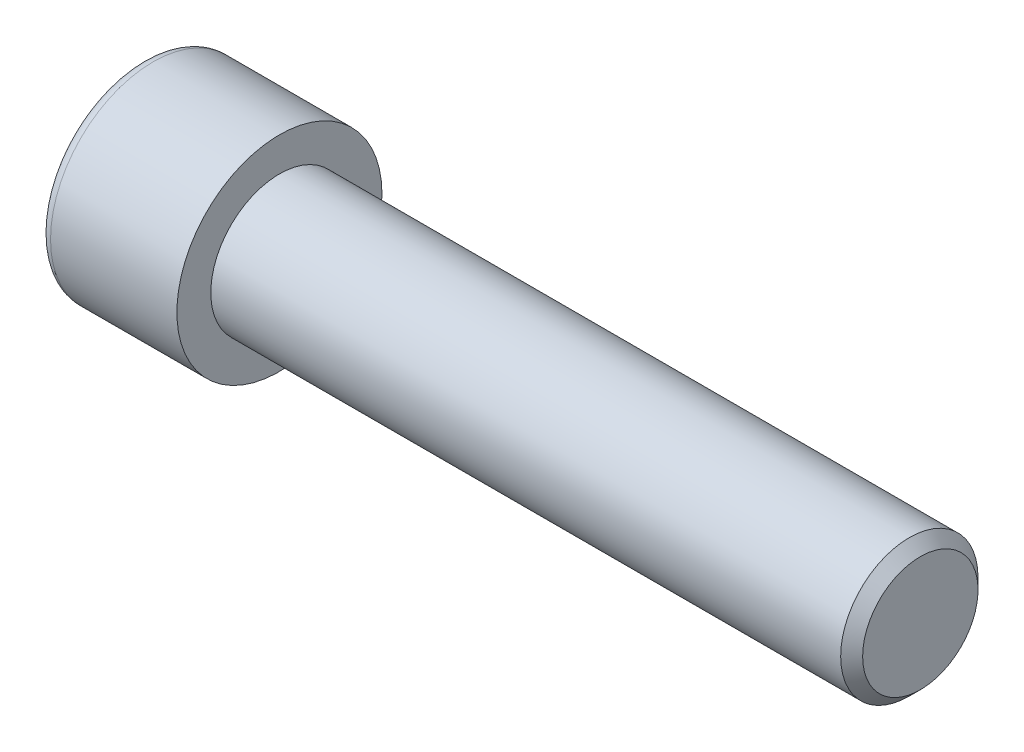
ISO-10303-21;
HEADER;
FILE_DESCRIPTION(('STEP AP214'),'2;1');
FILE_NAME('part.step','',(''),(''),'','','');
FILE_SCHEMA(('AUTOMOTIVE_DESIGN { 1 0 10303 214 1 1 1 1 }'));
ENDSEC;
DATA;
#1=APPLICATION_CONTEXT('core data for automotive mechanical design processes');
#2=APPLICATION_PROTOCOL_DEFINITION('international standard','automotive_design',2000,#1);
#3=PRODUCT_CONTEXT('',#1,'mechanical');
#4=PRODUCT('Part','Part','',(#3));
#5=PRODUCT_RELATED_PRODUCT_CATEGORY('part','',(#4));
#6=PRODUCT_DEFINITION_FORMATION('','',#4);
#7=PRODUCT_DEFINITION_CONTEXT('part definition',#1,'design');
#8=PRODUCT_DEFINITION('design','',#6,#7);
#9=PRODUCT_DEFINITION_SHAPE('','',#8);
#10=(LENGTH_UNIT() NAMED_UNIT(*) SI_UNIT(.MILLI.,.METRE.));
#11=(NAMED_UNIT(*) PLANE_ANGLE_UNIT() SI_UNIT($,.RADIAN.));
#12=(NAMED_UNIT(*) SI_UNIT($,.STERADIAN.) SOLID_ANGLE_UNIT());
#13=UNCERTAINTY_MEASURE_WITH_UNIT(LENGTH_MEASURE(1.E-05),#10,'distance_accuracy_value','');
#14=(GEOMETRIC_REPRESENTATION_CONTEXT(3) GLOBAL_UNCERTAINTY_ASSIGNED_CONTEXT((#13)) GLOBAL_UNIT_ASSIGNED_CONTEXT((#10,
#11,#12)) REPRESENTATION_CONTEXT('',''));
#15=CARTESIAN_POINT('',(0.,0.,0.));
#16=DIRECTION('',(0.,0.,1.));
#17=DIRECTION('',(1.,0.,0.));
#18=AXIS2_PLACEMENT_3D('',#15,#16,#17);
#19=CARTESIAN_POINT('',(0.,7.112,0.));
#20=DIRECTION('',(-1.,0.,0.));
#21=DIRECTION('',(0.,0.,1.));
#22=AXIS2_PLACEMENT_3D('',#19,#20,#21);
#23=PLANE('',#22);
#24=DIRECTION('',(0.,-0.866025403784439,0.5));
#25=VECTOR('',#24,1.);
#26=CARTESIAN_POINT('',(0.,0.,-4.57538541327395));
#27=LINE('',#26,#25);
#28=CARTESIAN_POINT('',(0.,0.,-4.57538541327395));
#29=VERTEX_POINT('',#28);
#30=CARTESIAN_POINT('',(0.,-3.9624,-2.28769270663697));
#31=VERTEX_POINT('',#30);
#32=EDGE_CURVE('E48',#29,#31,#27,.T.);
#33=ORIENTED_EDGE('',*,*,#32,.F.);
#34=DIRECTION('',(0.,-0.866025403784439,-0.5));
#35=VECTOR('',#34,1.);
#36=CARTESIAN_POINT('',(0.,3.9624,-2.28769270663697));
#37=LINE('',#36,#35);
#38=CARTESIAN_POINT('',(0.,3.9624,-2.28769270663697));
#39=VERTEX_POINT('',#38);
#40=EDGE_CURVE('E131',#39,#29,#37,.T.);
#41=ORIENTED_EDGE('',*,*,#40,.F.);
#42=DIRECTION('',(0.,0.,-1.));
#43=VECTOR('',#42,1.);
#44=CARTESIAN_POINT('',(0.,3.9624,2.28769270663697));
#45=LINE('',#44,#43);
#46=CARTESIAN_POINT('',(0.,3.9624,2.28769270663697));
#47=VERTEX_POINT('',#46);
#48=EDGE_CURVE('E129',#47,#39,#45,.T.);
#49=ORIENTED_EDGE('',*,*,#48,.F.);
#50=DIRECTION('',(0.,0.866025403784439,-0.5));
#51=VECTOR('',#50,1.);
#52=CARTESIAN_POINT('',(0.,0.,4.57538541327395));
#53=LINE('',#52,#51);
#54=CARTESIAN_POINT('',(0.,0.,4.57538541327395));
#55=VERTEX_POINT('',#54);
#56=EDGE_CURVE('E96',#55,#47,#53,.T.);
#57=ORIENTED_EDGE('',*,*,#56,.F.);
#58=DIRECTION('',(0.,0.866025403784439,0.5));
#59=VECTOR('',#58,1.);
#60=CARTESIAN_POINT('',(0.,-3.9624,2.28769270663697));
#61=LINE('',#60,#59);
#62=CARTESIAN_POINT('',(0.,-3.9624,2.28769270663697));
#63=VERTEX_POINT('',#62);
#64=EDGE_CURVE('E125',#63,#55,#61,.T.);
#65=ORIENTED_EDGE('',*,*,#64,.F.);
#66=DIRECTION('',(0.,0.,1.));
#67=VECTOR('',#66,1.);
#68=CARTESIAN_POINT('',(0.,-3.9624,-2.28769270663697));
#69=LINE('',#68,#67);
#70=EDGE_CURVE('E122',#31,#63,#69,.T.);
#71=ORIENTED_EDGE('',*,*,#70,.F.);
#72=EDGE_LOOP('',(#33,#41,#49,#57,#65,#71));
#73=FACE_BOUND('',#72,.T.);
#74=CARTESIAN_POINT('',(0.,0.,0.));
#75=DIRECTION('',(-1.,0.,0.));
#76=DIRECTION('',(0.,0.,1.));
#77=AXIS2_PLACEMENT_3D('',#74,#75,#76);
#78=CIRCLE('',#77,6.35);
#79=CARTESIAN_POINT('',(0.,0.,6.35));
#80=VERTEX_POINT('',#79);
#81=EDGE_CURVE('E11',#80,#80,#78,.T.);
#82=ORIENTED_EDGE('',*,*,#81,.T.);
#83=EDGE_LOOP('',(#82));
#84=FACE_BOUND('',#83,.T.);
#85=ADVANCED_FACE('F33',(#73,#84),#23,.T.);
#86=CARTESIAN_POINT('',(53.975,0.,0.));
#87=DIRECTION('',(1.,0.,0.));
#88=DIRECTION('',(0.,0.,-1.));
#89=AXIS2_PLACEMENT_3D('',#86,#87,#88);
#90=PLANE('',#89);
#91=CARTESIAN_POINT('',(53.975,0.,0.));
#92=DIRECTION('',(1.,0.,0.));
#93=DIRECTION('',(0.,0.,-1.));
#94=AXIS2_PLACEMENT_3D('',#91,#92,#93);
#95=CIRCLE('',#94,4.0005);
#96=CARTESIAN_POINT('',(53.975,0.,4.00050000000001));
#97=VERTEX_POINT('',#96);
#98=EDGE_CURVE('E146',#97,#97,#95,.T.);
#99=ORIENTED_EDGE('',*,*,#98,.T.);
#100=EDGE_LOOP('',(#99));
#101=FACE_BOUND('',#100,.T.);
#102=ADVANCED_FACE('F170',(#101),#90,.T.);
#103=CARTESIAN_POINT('',(0.,0.,0.));
#104=DIRECTION('',(1.,0.,0.));
#105=DIRECTION('',(0.,0.,-1.));
#106=AXIS2_PLACEMENT_3D('',#103,#104,#105);
#107=CYLINDRICAL_SURFACE('',#106,4.7625);
#108=CARTESIAN_POINT('',(53.213,0.,0.));
#109=DIRECTION('',(1.,0.,0.));
#110=DIRECTION('',(0.,0.,-1.));
#111=AXIS2_PLACEMENT_3D('',#108,#109,#110);
#112=CIRCLE('',#111,4.7625);
#113=CARTESIAN_POINT('',(53.213,0.,4.76250000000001));
#114=VERTEX_POINT('',#113);
#115=EDGE_CURVE('E149',#114,#114,#112,.F.);
#116=ORIENTED_EDGE('',*,*,#115,.T.);
#117=EDGE_LOOP('',(#116));
#118=FACE_BOUND('',#117,.T.);
#119=CARTESIAN_POINT('',(9.525,0.,0.));
#120=DIRECTION('',(1.,0.,0.));
#121=DIRECTION('',(0.,0.,-1.));
#122=AXIS2_PLACEMENT_3D('',#119,#120,#121);
#123=CIRCLE('',#122,4.7625);
#124=CARTESIAN_POINT('',(9.525,0.,-4.7625));
#125=VERTEX_POINT('',#124);
#126=EDGE_CURVE('E143',#125,#125,#123,.T.);
#127=ORIENTED_EDGE('',*,*,#126,.T.);
#128=EDGE_LOOP('',(#127));
#129=FACE_BOUND('',#128,.T.);
#130=ADVANCED_FACE('F176',(#118,#129),#107,.T.);
#131=CARTESIAN_POINT('',(9.525,4.7625,0.));
#132=DIRECTION('',(1.,0.,0.));
#133=DIRECTION('',(0.,0.,-1.));
#134=AXIS2_PLACEMENT_3D('',#131,#132,#133);
#135=PLANE('',#134);
#136=CARTESIAN_POINT('',(9.525,0.,0.));
#137=DIRECTION('',(1.,0.,0.));
#138=DIRECTION('',(0.,0.,-1.));
#139=AXIS2_PLACEMENT_3D('',#136,#137,#138);
#140=CIRCLE('',#139,7.112);
#141=CARTESIAN_POINT('',(9.525,0.,-7.112));
#142=VERTEX_POINT('',#141);
#143=EDGE_CURVE('E135',#142,#142,#140,.T.);
#144=ORIENTED_EDGE('',*,*,#143,.T.);
#145=EDGE_LOOP('',(#144));
#146=FACE_BOUND('',#145,.T.);
#147=ORIENTED_EDGE('',*,*,#126,.F.);
#148=EDGE_LOOP('',(#147));
#149=FACE_BOUND('',#148,.T.);
#150=ADVANCED_FACE('F183',(#146,#149),#135,.T.);
#151=CARTESIAN_POINT('',(0.,0.,0.));
#152=DIRECTION('',(1.,0.,0.));
#153=DIRECTION('',(0.,0.,-1.));
#154=AXIS2_PLACEMENT_3D('',#151,#152,#153);
#155=CYLINDRICAL_SURFACE('',#154,7.112);
#156=CARTESIAN_POINT('',(0.762,0.,0.));
#157=DIRECTION('',(-1.,0.,0.));
#158=DIRECTION('',(0.,0.,1.));
#159=AXIS2_PLACEMENT_3D('',#156,#157,#158);
#160=CIRCLE('',#159,7.112);
#161=CARTESIAN_POINT('',(0.762,0.,7.112));
#162=VERTEX_POINT('',#161);
#163=EDGE_CURVE('E41',#162,#162,#160,.F.);
#164=ORIENTED_EDGE('',*,*,#163,.T.);
#165=EDGE_LOOP('',(#164));
#166=FACE_BOUND('',#165,.T.);
#167=ORIENTED_EDGE('',*,*,#143,.F.);
#168=EDGE_LOOP('',(#167));
#169=FACE_BOUND('',#168,.T.);
#170=ADVANCED_FACE('F154',(#166,#169),#155,.T.);
#171=CARTESIAN_POINT('',(53.975,0.,0.));
#172=DIRECTION('',(-1.,0.,0.));
#173=DIRECTION('',(0.,0.,1.));
#174=AXIS2_PLACEMENT_3D('',#171,#172,#173);
#175=CONICAL_SURFACE('',#174,4.0005,0.78539816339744);
#176=CARTESIAN_POINT('',(53.213,0.,4.76250000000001));
#177=CARTESIAN_POINT('',(53.2209375,0.,4.75456250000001));
#178=CARTESIAN_POINT('',(53.228875,0.,4.74662500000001));
#179=CARTESIAN_POINT('',(53.24475,0.,4.73075000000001));
#180=CARTESIAN_POINT('',(53.2526875,0.,4.72281250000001));
#181=CARTESIAN_POINT('',(53.2685625,0.,4.70693750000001));
#182=CARTESIAN_POINT('',(53.2765,0.,4.69900000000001));
#183=CARTESIAN_POINT('',(53.292375,0.,4.68312500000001));
#184=CARTESIAN_POINT('',(53.3003125,0.,4.67518750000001));
#185=CARTESIAN_POINT('',(53.3161875,0.,4.65931250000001));
#186=CARTESIAN_POINT('',(53.324125,0.,4.65137500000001));
#187=CARTESIAN_POINT('',(53.34,0.,4.63550000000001));
#188=CARTESIAN_POINT('',(53.3479375,0.,4.62756250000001));
#189=CARTESIAN_POINT('',(53.3638125,0.,4.61168750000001));
#190=CARTESIAN_POINT('',(53.37175,0.,4.60375000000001));
#191=CARTESIAN_POINT('',(53.387625,0.,4.58787500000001));
#192=CARTESIAN_POINT('',(53.3955625,0.,4.57993750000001));
#193=CARTESIAN_POINT('',(53.4114375,0.,4.56406250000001));
#194=CARTESIAN_POINT('',(53.419375,0.,4.55612500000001));
#195=CARTESIAN_POINT('',(53.43525,0.,4.54025000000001));
#196=CARTESIAN_POINT('',(53.4431875,0.,4.53231250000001));
#197=CARTESIAN_POINT('',(53.4590625,0.,4.51643750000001));
#198=CARTESIAN_POINT('',(53.467,0.,4.50850000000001));
#199=CARTESIAN_POINT('',(53.482875,0.,4.49262500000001));
#200=CARTESIAN_POINT('',(53.4908125,0.,4.48468750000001));
#201=CARTESIAN_POINT('',(53.5066875,0.,4.46881250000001));
#202=CARTESIAN_POINT('',(53.514625,0.,4.46087500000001));
#203=CARTESIAN_POINT('',(53.5305,0.,4.44500000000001));
#204=CARTESIAN_POINT('',(53.5384375,0.,4.43706250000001));
#205=CARTESIAN_POINT('',(53.5543125,0.,4.42118750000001));
#206=CARTESIAN_POINT('',(53.56225,0.,4.41325000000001));
#207=CARTESIAN_POINT('',(53.578125,0.,4.39737500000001));
#208=CARTESIAN_POINT('',(53.5860625,0.,4.38943750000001));
#209=CARTESIAN_POINT('',(53.6019375,0.,4.37356250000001));
#210=CARTESIAN_POINT('',(53.609875,0.,4.36562500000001));
#211=CARTESIAN_POINT('',(53.62575,0.,4.34975000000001));
#212=CARTESIAN_POINT('',(53.6336875,0.,4.34181250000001));
#213=CARTESIAN_POINT('',(53.6495625,0.,4.32593750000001));
#214=CARTESIAN_POINT('',(53.6575,0.,4.31800000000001));
#215=CARTESIAN_POINT('',(53.673375,0.,4.30212500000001));
#216=CARTESIAN_POINT('',(53.6813125,0.,4.29418750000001));
#217=CARTESIAN_POINT('',(53.6971875,0.,4.27831250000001));
#218=CARTESIAN_POINT('',(53.705125,0.,4.27037500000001));
#219=CARTESIAN_POINT('',(53.721,0.,4.25450000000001));
#220=CARTESIAN_POINT('',(53.7289375,0.,4.24656250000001));
#221=CARTESIAN_POINT('',(53.7448125,0.,4.23068750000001));
#222=CARTESIAN_POINT('',(53.75275,0.,4.22275000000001));
#223=CARTESIAN_POINT('',(53.768625,0.,4.20687500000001));
#224=CARTESIAN_POINT('',(53.7765625,0.,4.19893750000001));
#225=CARTESIAN_POINT('',(53.7924375,0.,4.18306250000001));
#226=CARTESIAN_POINT('',(53.800375,0.,4.17512500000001));
#227=CARTESIAN_POINT('',(53.81625,0.,4.15925000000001));
#228=CARTESIAN_POINT('',(53.8241875,0.,4.15131250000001));
#229=CARTESIAN_POINT('',(53.8400625,0.,4.13543750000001));
#230=CARTESIAN_POINT('',(53.848,0.,4.12750000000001));
#231=CARTESIAN_POINT('',(53.863875,0.,4.11162500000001));
#232=CARTESIAN_POINT('',(53.8718125,0.,4.10368750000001));
#233=CARTESIAN_POINT('',(53.8876875,0.,4.08781250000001));
#234=CARTESIAN_POINT('',(53.895625,0.,4.07987500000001));
#235=CARTESIAN_POINT('',(53.9115,0.,4.06400000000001));
#236=CARTESIAN_POINT('',(53.9194375,0.,4.05606250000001));
#237=CARTESIAN_POINT('',(53.9353125,0.,4.04018750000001));
#238=CARTESIAN_POINT('',(53.94325,0.,4.03225000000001));
#239=CARTESIAN_POINT('',(53.959125,0.,4.01637500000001));
#240=CARTESIAN_POINT('',(53.9670625,0.,4.00843750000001));
#241=CARTESIAN_POINT('',(53.975,0.,4.00050000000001));
#242=B_SPLINE_CURVE_WITH_KNOTS('',3,(#176,#177,#178,#179,#180,#181,#182,#183,#184,#185,#186,
#187,#188,#189,#190,#191,#192,#193,#194,#195,#196,#197,#198,#199,#200,#201,#202,#203,#204,#205,
#206,#207,#208,#209,#210,#211,#212,#213,#214,#215,#216,#217,#218,#219,#220,#221,#222,#223,#224,
#225,#226,#227,#228,#229,#230,#231,#232,#233,#234,#235,#236,#237,#238,#239,#240,#241),
.UNSPECIFIED.,.F.,.F.,(4,2,2,2,2,2,2,2,2,2,2,2,2,2,2,2,2,2,2,2,2,2,2,2,2,2,2,2,2,2,2,2,4),(0.,
0.0336759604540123,0.0673519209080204,0.101027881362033,0.134703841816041,0.168379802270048,
0.202055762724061,0.235731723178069,0.269407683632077,0.30308364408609,0.336759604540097,
0.37043556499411,0.404111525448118,0.437787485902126,0.471463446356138,0.505139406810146,
0.538815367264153,0.572491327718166,0.606167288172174,0.639843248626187,0.673519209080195,
0.707195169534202,0.740871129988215,0.774547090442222,0.808223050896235,0.841899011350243,
0.875574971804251,0.909250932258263,0.942926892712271,0.976602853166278,1.01027881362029,
1.0439547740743,1.07763073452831),.UNSPECIFIED.);
#243=EDGE_CURVE('BSEAM159',#114,#97,#242,.T.);
#244=ORIENTED_EDGE('',*,*,#115,.F.);
#245=ORIENTED_EDGE('',*,*,#98,.F.);
#246=ORIENTED_EDGE('',*,*,#243,.T.);
#247=ORIENTED_EDGE('',*,*,#243,.F.);
#248=EDGE_LOOP('',(#244,#246,#245,#247));
#249=FACE_BOUND('',#248,.T.);
#250=ADVANCED_FACE('F159',(#249),#175,.T.);
#251=CARTESIAN_POINT('',(0.762,0.,0.));
#252=DIRECTION('',(-1.,0.,0.));
#253=DIRECTION('',(0.,0.,1.));
#254=AXIS2_PLACEMENT_3D('',#251,#252,#253);
#255=TOROIDAL_SURFACE('',#254,6.35,0.762);
#256=ORIENTED_EDGE('',*,*,#81,.F.);
#257=EDGE_LOOP('',(#256));
#258=FACE_BOUND('',#257,.T.);
#259=ORIENTED_EDGE('',*,*,#163,.F.);
#260=EDGE_LOOP('',(#259));
#261=FACE_BOUND('',#260,.T.);
#262=ADVANCED_FACE('F35',(#258,#261),#255,.T.);
#263=CARTESIAN_POINT('',(5.08,0.,-4.57538541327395));
#264=DIRECTION('',(0.,-0.5,-0.866025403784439));
#265=DIRECTION('',(0.,0.866025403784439,-0.5));
#266=AXIS2_PLACEMENT_3D('',#263,#264,#265);
#267=PLANE('',#266);
#268=ORIENTED_EDGE('',*,*,#32,.T.);
#269=DIRECTION('',(-1.,0.,0.));
#270=VECTOR('',#269,1.);
#271=CARTESIAN_POINT('',(5.08,-3.9624,-2.28769270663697));
#272=LINE('',#271,#270);
#273=CARTESIAN_POINT('',(5.08,-3.9624,-2.28769270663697));
#274=VERTEX_POINT('',#273);
#275=EDGE_CURVE('E78',#274,#31,#272,.T.);
#276=ORIENTED_EDGE('',*,*,#275,.F.);
#277=DIRECTION('',(0.,-0.866025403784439,0.5));
#278=VECTOR('',#277,1.);
#279=CARTESIAN_POINT('',(5.08,0.,-4.57538541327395));
#280=LINE('',#279,#278);
#281=CARTESIAN_POINT('',(5.08,0.,-4.57538541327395));
#282=VERTEX_POINT('',#281);
#283=EDGE_CURVE('E133',#282,#274,#280,.T.);
#284=ORIENTED_EDGE('',*,*,#283,.F.);
#285=DIRECTION('',(-1.,0.,0.));
#286=VECTOR('',#285,1.);
#287=CARTESIAN_POINT('',(5.08,0.,-4.57538541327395));
#288=LINE('',#287,#286);
#289=EDGE_CURVE('E56',#282,#29,#288,.T.);
#290=ORIENTED_EDGE('',*,*,#289,.T.);
#291=EDGE_LOOP('',(#268,#276,#284,#290));
#292=FACE_BOUND('',#291,.T.);
#293=ADVANCED_FACE('F158',(#292),#267,.F.);
#294=CARTESIAN_POINT('',(5.08,3.9624,-2.28769270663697));
#295=DIRECTION('',(0.,0.5,-0.866025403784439));
#296=DIRECTION('',(0.,0.866025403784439,0.5));
#297=AXIS2_PLACEMENT_3D('',#294,#295,#296);
#298=PLANE('',#297);
#299=ORIENTED_EDGE('',*,*,#40,.T.);
#300=ORIENTED_EDGE('',*,*,#289,.F.);
#301=DIRECTION('',(0.,-0.866025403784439,-0.5));
#302=VECTOR('',#301,1.);
#303=CARTESIAN_POINT('',(5.08,3.9624,-2.28769270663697));
#304=LINE('',#303,#302);
#305=CARTESIAN_POINT('',(5.08,3.9624,-2.28769270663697));
#306=VERTEX_POINT('',#305);
#307=EDGE_CURVE('E108',#306,#282,#304,.T.);
#308=ORIENTED_EDGE('',*,*,#307,.F.);
#309=DIRECTION('',(-1.,0.,0.));
#310=VECTOR('',#309,1.);
#311=CARTESIAN_POINT('',(5.08,3.9624,-2.28769270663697));
#312=LINE('',#311,#310);
#313=EDGE_CURVE('E100',#306,#39,#312,.T.);
#314=ORIENTED_EDGE('',*,*,#313,.T.);
#315=EDGE_LOOP('',(#299,#300,#308,#314));
#316=FACE_BOUND('',#315,.T.);
#317=ADVANCED_FACE('F165',(#316),#298,.F.);
#318=CARTESIAN_POINT('',(5.08,3.9624,2.28769270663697));
#319=DIRECTION('',(0.,1.,0.));
#320=DIRECTION('',(0.,0.,1.));
#321=AXIS2_PLACEMENT_3D('',#318,#319,#320);
#322=PLANE('',#321);
#323=ORIENTED_EDGE('',*,*,#48,.T.);
#324=ORIENTED_EDGE('',*,*,#313,.F.);
#325=DIRECTION('',(0.,0.,-1.));
#326=VECTOR('',#325,1.);
#327=CARTESIAN_POINT('',(5.08,3.9624,2.28769270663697));
#328=LINE('',#327,#326);
#329=CARTESIAN_POINT('',(5.08,3.9624,2.28769270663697));
#330=VERTEX_POINT('',#329);
#331=EDGE_CURVE('E104',#330,#306,#328,.T.);
#332=ORIENTED_EDGE('',*,*,#331,.F.);
#333=DIRECTION('',(-1.,0.,0.));
#334=VECTOR('',#333,1.);
#335=CARTESIAN_POINT('',(5.08,3.9624,2.28769270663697));
#336=LINE('',#335,#334);
#337=EDGE_CURVE('E89',#330,#47,#336,.T.);
#338=ORIENTED_EDGE('',*,*,#337,.T.);
#339=EDGE_LOOP('',(#323,#324,#332,#338));
#340=FACE_BOUND('',#339,.T.);
#341=ADVANCED_FACE('F105',(#340),#322,.F.);
#342=CARTESIAN_POINT('',(5.08,0.,4.57538541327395));
#343=DIRECTION('',(0.,0.5,0.866025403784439));
#344=DIRECTION('',(0.,-0.866025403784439,0.5));
#345=AXIS2_PLACEMENT_3D('',#342,#343,#344);
#346=PLANE('',#345);
#347=ORIENTED_EDGE('',*,*,#56,.T.);
#348=ORIENTED_EDGE('',*,*,#337,.F.);
#349=DIRECTION('',(0.,0.866025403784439,-0.5));
#350=VECTOR('',#349,1.);
#351=CARTESIAN_POINT('',(5.08,0.,4.57538541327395));
#352=LINE('',#351,#350);
#353=CARTESIAN_POINT('',(5.08,0.,4.57538541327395));
#354=VERTEX_POINT('',#353);
#355=EDGE_CURVE('E93',#354,#330,#352,.T.);
#356=ORIENTED_EDGE('',*,*,#355,.F.);
#357=DIRECTION('',(-1.,0.,0.));
#358=VECTOR('',#357,1.);
#359=CARTESIAN_POINT('',(5.08,0.,4.57538541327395));
#360=LINE('',#359,#358);
#361=EDGE_CURVE('E101',#354,#55,#360,.T.);
#362=ORIENTED_EDGE('',*,*,#361,.T.);
#363=EDGE_LOOP('',(#347,#348,#356,#362));
#364=FACE_BOUND('',#363,.T.);
#365=ADVANCED_FACE('F91',(#364),#346,.F.);
#366=CARTESIAN_POINT('',(5.08,-3.9624,2.28769270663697));
#367=DIRECTION('',(0.,-0.5,0.866025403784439));
#368=DIRECTION('',(0.,-0.866025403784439,-0.5));
#369=AXIS2_PLACEMENT_3D('',#366,#367,#368);
#370=PLANE('',#369);
#371=ORIENTED_EDGE('',*,*,#64,.T.);
#372=ORIENTED_EDGE('',*,*,#361,.F.);
#373=DIRECTION('',(0.,0.866025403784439,0.5));
#374=VECTOR('',#373,1.);
#375=CARTESIAN_POINT('',(5.08,-3.9624,2.28769270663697));
#376=LINE('',#375,#374);
#377=CARTESIAN_POINT('',(5.08,-3.9624,2.28769270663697));
#378=VERTEX_POINT('',#377);
#379=EDGE_CURVE('E114',#378,#354,#376,.T.);
#380=ORIENTED_EDGE('',*,*,#379,.F.);
#381=DIRECTION('',(-1.,0.,0.));
#382=VECTOR('',#381,1.);
#383=CARTESIAN_POINT('',(5.08,-3.9624,2.28769270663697));
#384=LINE('',#383,#382);
#385=EDGE_CURVE('E138',#378,#63,#384,.T.);
#386=ORIENTED_EDGE('',*,*,#385,.T.);
#387=EDGE_LOOP('',(#371,#372,#380,#386));
#388=FACE_BOUND('',#387,.T.);
#389=ADVANCED_FACE('F193',(#388),#370,.F.);
#390=CARTESIAN_POINT('',(5.08,-3.9624,-2.28769270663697));
#391=DIRECTION('',(0.,-1.,0.));
#392=DIRECTION('',(0.,0.,-1.));
#393=AXIS2_PLACEMENT_3D('',#390,#391,#392);
#394=PLANE('',#393);
#395=ORIENTED_EDGE('',*,*,#70,.T.);
#396=ORIENTED_EDGE('',*,*,#385,.F.);
#397=DIRECTION('',(0.,0.,1.));
#398=VECTOR('',#397,1.);
#399=CARTESIAN_POINT('',(5.08,-3.9624,-2.28769270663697));
#400=LINE('',#399,#398);
#401=EDGE_CURVE('E116',#274,#378,#400,.T.);
#402=ORIENTED_EDGE('',*,*,#401,.F.);
#403=ORIENTED_EDGE('',*,*,#275,.T.);
#404=EDGE_LOOP('',(#395,#396,#402,#403));
#405=FACE_BOUND('',#404,.T.);
#406=ADVANCED_FACE('F190',(#405),#394,.F.);
#407=CARTESIAN_POINT('',(5.08,0.,0.));
#408=DIRECTION('',(-1.,0.,0.));
#409=DIRECTION('',(0.,0.,1.));
#410=AXIS2_PLACEMENT_3D('',#407,#408,#409);
#411=PLANE('',#410);
#412=ORIENTED_EDGE('',*,*,#283,.T.);
#413=ORIENTED_EDGE('',*,*,#401,.T.);
#414=ORIENTED_EDGE('',*,*,#379,.T.);
#415=ORIENTED_EDGE('',*,*,#355,.T.);
#416=ORIENTED_EDGE('',*,*,#331,.T.);
#417=ORIENTED_EDGE('',*,*,#307,.T.);
#418=EDGE_LOOP('',(#412,#413,#414,#415,#416,#417));
#419=FACE_BOUND('',#418,.T.);
#420=ADVANCED_FACE('F111',(#419),#411,.T.);
#421=CLOSED_SHELL('',(#85,#102,#130,#150,#170,#250,#262,#293,#317,#341,#365,#389,#406,#420));
#422=MANIFOLD_SOLID_BREP('B2',#421);
#423=ADVANCED_BREP_SHAPE_REPRESENTATION('',(#18,#422),#14);
#424=SHAPE_DEFINITION_REPRESENTATION(#9,#423);
ENDSEC;
END-ISO-10303-21;
